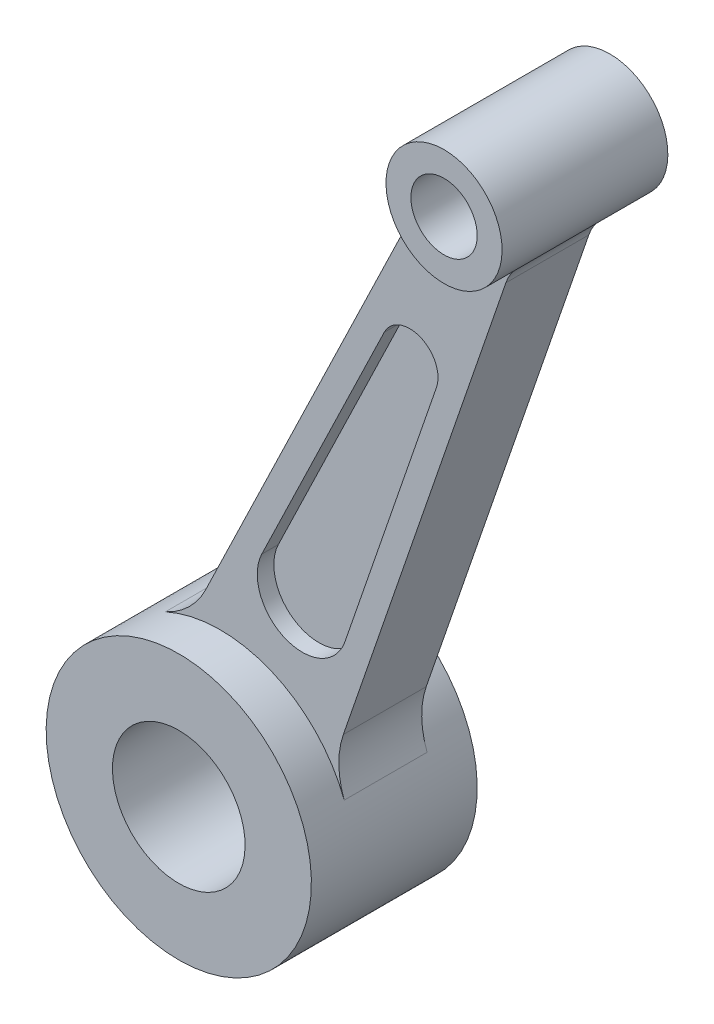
ISO-10303-21;
HEADER;
FILE_DESCRIPTION(('STEP AP214'),'2;1');
FILE_NAME('part.step','',(''),(''),'','','');
FILE_SCHEMA(('AUTOMOTIVE_DESIGN { 1 0 10303 214 1 1 1 1 }'));
ENDSEC;
DATA;
#1=APPLICATION_CONTEXT('core data for automotive mechanical design processes');
#2=APPLICATION_PROTOCOL_DEFINITION('international standard','automotive_design',2000,#1);
#3=PRODUCT_CONTEXT('',#1,'mechanical');
#4=PRODUCT('Part','Part','',(#3));
#5=PRODUCT_RELATED_PRODUCT_CATEGORY('part','',(#4));
#6=PRODUCT_DEFINITION_FORMATION('','',#4);
#7=PRODUCT_DEFINITION_CONTEXT('part definition',#1,'design');
#8=PRODUCT_DEFINITION('design','',#6,#7);
#9=PRODUCT_DEFINITION_SHAPE('','',#8);
#10=(LENGTH_UNIT() NAMED_UNIT(*) SI_UNIT(.MILLI.,.METRE.));
#11=(NAMED_UNIT(*) PLANE_ANGLE_UNIT() SI_UNIT($,.RADIAN.));
#12=(NAMED_UNIT(*) SI_UNIT($,.STERADIAN.) SOLID_ANGLE_UNIT());
#13=UNCERTAINTY_MEASURE_WITH_UNIT(LENGTH_MEASURE(1.E-05),#10,'distance_accuracy_value','');
#14=(GEOMETRIC_REPRESENTATION_CONTEXT(3) GLOBAL_UNCERTAINTY_ASSIGNED_CONTEXT((#13)) GLOBAL_UNIT_ASSIGNED_CONTEXT((#10,
#11,#12)) REPRESENTATION_CONTEXT('',''));
#15=CARTESIAN_POINT('',(0.,0.,0.));
#16=DIRECTION('',(0.,0.,1.));
#17=DIRECTION('',(1.,0.,0.));
#18=AXIS2_PLACEMENT_3D('',#15,#16,#17);
#19=CARTESIAN_POINT('',(-407.921191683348,-103.295185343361,326.402522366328));
#20=DIRECTION('',(0.,0.,1.));
#21=DIRECTION('',(0.924594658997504,-0.380952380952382,0.));
#22=AXIS2_PLACEMENT_3D('',#19,#20,#21);
#23=PLANE('',#22);
#24=CARTESIAN_POINT('',(-396.363758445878,-108.057090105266,326.402522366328));
#25=DIRECTION('',(0.,0.,1.));
#26=DIRECTION('',(0.924594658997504,-0.380952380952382,0.));
#27=AXIS2_PLACEMENT_3D('',#24,#25,#26);
#28=CIRCLE('',#27,17.5);
#29=CARTESIAN_POINT('',(-385.41330331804,-121.707640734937,326.402522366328));
#30=VERTEX_POINT('',#29);
#31=CARTESIAN_POINT('',(-413.75202252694,-110.031494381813,326.402522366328));
#32=VERTEX_POINT('',#31);
#33=EDGE_CURVE('E221',#30,#32,#28,.F.);
#34=ORIENTED_EDGE('',*,*,#33,.T.);
#35=CARTESIAN_POINT('',(-428.656248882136,-111.723840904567,326.402522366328));
#36=DIRECTION('',(0.,0.,1.));
#37=DIRECTION('',(0.924594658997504,-0.380952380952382,0.));
#38=AXIS2_PLACEMENT_3D('',#35,#36,#37);
#39=CIRCLE('',#38,15.);
#40=CARTESIAN_POINT('',(-415.151368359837,-118.252102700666,326.402522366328));
#41=VERTEX_POINT('',#40);
#42=EDGE_CURVE('E252',#32,#41,#39,.F.);
#43=ORIENTED_EDGE('',*,*,#42,.T.);
#44=DIRECTION('',(-0.43521745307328,-0.900325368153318,0.));
#45=VECTOR('',#44,1.);
#46=CARTESIAN_POINT('',(-407.921191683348,-103.295185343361,326.402522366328));
#47=LINE('',#46,#45);
#48=CARTESIAN_POINT('',(-480.733067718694,-253.91961144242,326.402522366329));
#49=VERTEX_POINT('',#48);
#50=EDGE_CURVE('E230',#41,#49,#47,.T.);
#51=ORIENTED_EDGE('',*,*,#50,.T.);
#52=CARTESIAN_POINT('',(-503.241201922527,-243.039175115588,326.402522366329));
#53=DIRECTION('',(0.,0.,1.));
#54=DIRECTION('',(0.924594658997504,-0.380952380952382,0.));
#55=AXIS2_PLACEMENT_3D('',#52,#53,#54);
#56=CIRCLE('',#55,25.);
#57=CARTESIAN_POINT('',(-492.903723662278,-265.801787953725,326.402522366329));
#58=VERTEX_POINT('',#57);
#59=EDGE_CURVE('E272',#49,#58,#56,.F.);
#60=ORIENTED_EDGE('',*,*,#59,.T.);
#61=CARTESIAN_POINT('',(-476.363758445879,-302.221968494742,326.402522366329));
#62=DIRECTION('',(0.,0.,1.));
#63=DIRECTION('',(0.924594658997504,-0.380952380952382,0.));
#64=AXIS2_PLACEMENT_3D('',#61,#62,#63);
#65=CIRCLE('',#64,40.);
#66=CARTESIAN_POINT('',(-438.968200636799,-288.024354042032,326.402522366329));
#67=VERTEX_POINT('',#66);
#68=EDGE_CURVE('E213',#58,#67,#65,.F.);
#69=ORIENTED_EDGE('',*,*,#68,.T.);
#70=CARTESIAN_POINT('',(-415.595977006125,-279.150845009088,326.402522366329));
#71=DIRECTION('',(0.,0.,1.));
#72=DIRECTION('',(0.924594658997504,-0.380952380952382,0.));
#73=AXIS2_PLACEMENT_3D('',#70,#71,#72);
#74=CIRCLE('',#73,25.);
#75=CARTESIAN_POINT('',(-439.235894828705,-271.017316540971,326.402522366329));
#76=VERTEX_POINT('',#75);
#77=EDGE_CURVE('E9',#67,#76,#74,.F.);
#78=ORIENTED_EDGE('',*,*,#77,.T.);
#79=DIRECTION('',(-0.325341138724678,-0.945596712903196,0.));
#80=VECTOR('',#79,1.);
#81=CARTESIAN_POINT('',(-384.80632520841,-112.818994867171,326.402522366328));
#82=LINE('',#81,#80);
#83=CARTESIAN_POINT('',(-390.211149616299,-128.527995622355,326.402522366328));
#84=VERTEX_POINT('',#83);
#85=EDGE_CURVE('E233',#84,#76,#82,.T.);
#86=ORIENTED_EDGE('',*,*,#85,.F.);
#87=CARTESIAN_POINT('',(-376.027198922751,-133.408112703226,326.402522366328));
#88=DIRECTION('',(0.,0.,1.));
#89=DIRECTION('',(0.924594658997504,-0.380952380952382,0.));
#90=AXIS2_PLACEMENT_3D('',#87,#88,#89);
#91=CIRCLE('',#90,15.);
#92=EDGE_CURVE('E256',#84,#30,#91,.F.);
#93=ORIENTED_EDGE('',*,*,#92,.T.);
#94=EDGE_LOOP('',(#34,#43,#51,#60,#69,#78,#86,#93));
#95=FACE_BOUND('',#94,.T.);
#96=DIRECTION('',(-0.43521745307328,-0.900325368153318,0.));
#97=VECTOR('',#96,1.);
#98=CARTESIAN_POINT('',(-426.91241044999,-159.814692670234,326.402522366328));
#99=LINE('',#98,#97);
#100=CARTESIAN_POINT('',(-426.91241044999,-159.814692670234,326.402522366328));
#101=VERTEX_POINT('',#100);
#102=CARTESIAN_POINT('',(-463.840532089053,-236.207136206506,326.402522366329));
#103=VERTEX_POINT('',#102);
#104=EDGE_CURVE('E183',#101,#103,#99,.T.);
#105=ORIENTED_EDGE('',*,*,#104,.F.);
#106=CARTESIAN_POINT('',(-419.220901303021,-163.532769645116,326.402522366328));
#107=DIRECTION('',(0.,0.,-1.));
#108=DIRECTION('',(-0.924594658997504,0.380952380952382,0.));
#109=AXIS2_PLACEMENT_3D('',#106,#107,#108);
#110=CIRCLE('',#109,8.54303279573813);
#111=CARTESIAN_POINT('',(-411.142637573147,-166.312169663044,326.402522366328));
#112=VERTEX_POINT('',#111);
#113=EDGE_CURVE('E136',#101,#112,#110,.T.);
#114=ORIENTED_EDGE('',*,*,#113,.T.);
#115=DIRECTION('',(0.325341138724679,0.945596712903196,0.));
#116=VECTOR('',#115,1.);
#117=CARTESIAN_POINT('',(-438.747773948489,-246.545878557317,326.402522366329));
#118=LINE('',#117,#116);
#119=CARTESIAN_POINT('',(-438.747773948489,-246.545878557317,326.402522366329));
#120=VERTEX_POINT('',#119);
#121=EDGE_CURVE('E177',#120,#112,#118,.T.);
#122=ORIENTED_EDGE('',*,*,#121,.F.);
#123=CARTESIAN_POINT('',(-451.601853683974,-242.123315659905,326.402522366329));
#124=DIRECTION('',(0.,0.,-1.));
#125=DIRECTION('',(-0.924594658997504,0.380952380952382,0.));
#126=AXIS2_PLACEMENT_3D('',#123,#124,#125);
#127=CIRCLE('',#126,13.5936171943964);
#128=EDGE_CURVE('E180',#120,#103,#127,.T.);
#129=ORIENTED_EDGE('',*,*,#128,.T.);
#130=EDGE_LOOP('',(#105,#114,#122,#129));
#131=FACE_BOUND('',#130,.T.);
#132=ADVANCED_FACE('F14',(#95,#131),#23,.T.);
#133=CARTESIAN_POINT('',(-407.921191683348,-103.295185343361,326.402522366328));
#134=DIRECTION('',(0.900325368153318,-0.43521745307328,0.));
#135=DIRECTION('',(0.43521745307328,0.900325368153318,0.));
#136=AXIS2_PLACEMENT_3D('',#133,#134,#135);
#137=PLANE('',#136);
#138=DIRECTION('',(-0.43521745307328,-0.900325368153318,0.));
#139=VECTOR('',#138,1.);
#140=CARTESIAN_POINT('',(-407.921191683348,-103.295185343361,301.402522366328));
#141=LINE('',#140,#139);
#142=CARTESIAN_POINT('',(-415.151368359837,-118.252102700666,301.402522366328));
#143=VERTEX_POINT('',#142);
#144=CARTESIAN_POINT('',(-480.733067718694,-253.91961144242,301.402522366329));
#145=VERTEX_POINT('',#144);
#146=EDGE_CURVE('E224',#143,#145,#141,.T.);
#147=ORIENTED_EDGE('',*,*,#146,.T.);
#148=DIRECTION('',(0.,0.,1.));
#149=VECTOR('',#148,1.);
#150=CARTESIAN_POINT('',(-480.733067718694,-253.91961144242,338.902522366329));
#151=LINE('',#150,#149);
#152=EDGE_CURVE('E266',#145,#49,#151,.T.);
#153=ORIENTED_EDGE('',*,*,#152,.T.);
#154=ORIENTED_EDGE('',*,*,#50,.F.);
#155=DIRECTION('',(0.,0.,1.));
#156=VECTOR('',#155,1.);
#157=CARTESIAN_POINT('',(-415.151368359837,-118.252102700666,338.902522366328));
#158=LINE('',#157,#156);
#159=EDGE_CURVE('E247',#41,#143,#158,.F.);
#160=ORIENTED_EDGE('',*,*,#159,.T.);
#161=EDGE_LOOP('',(#147,#153,#154,#160));
#162=FACE_BOUND('',#161,.T.);
#163=ADVANCED_FACE('F16',(#162),#137,.F.);
#164=CARTESIAN_POINT('',(-384.80632520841,-112.818994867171,326.402522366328));
#165=DIRECTION('',(0.945596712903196,-0.325341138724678,0.));
#166=DIRECTION('',(0.325341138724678,0.945596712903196,0.));
#167=AXIS2_PLACEMENT_3D('',#164,#165,#166);
#168=PLANE('',#167);
#169=ORIENTED_EDGE('',*,*,#85,.T.);
#170=DIRECTION('',(0.,0.,-1.));
#171=VECTOR('',#170,1.);
#172=CARTESIAN_POINT('',(-439.235894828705,-271.017316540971,326.402522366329));
#173=LINE('',#172,#171);
#174=CARTESIAN_POINT('',(-439.235894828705,-271.017316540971,301.402522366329));
#175=VERTEX_POINT('',#174);
#176=EDGE_CURVE('E268',#76,#175,#173,.T.);
#177=ORIENTED_EDGE('',*,*,#176,.T.);
#178=DIRECTION('',(-0.325341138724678,-0.945596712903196,0.));
#179=VECTOR('',#178,1.);
#180=CARTESIAN_POINT('',(-384.80632520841,-112.818994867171,301.402522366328));
#181=LINE('',#180,#179);
#182=CARTESIAN_POINT('',(-390.211149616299,-128.527995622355,301.402522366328));
#183=VERTEX_POINT('',#182);
#184=EDGE_CURVE('E227',#183,#175,#181,.T.);
#185=ORIENTED_EDGE('',*,*,#184,.F.);
#186=DIRECTION('',(0.,0.,-1.));
#187=VECTOR('',#186,1.);
#188=CARTESIAN_POINT('',(-390.211149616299,-128.527995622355,326.402522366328));
#189=LINE('',#188,#187);
#190=EDGE_CURVE('E249',#183,#84,#189,.F.);
#191=ORIENTED_EDGE('',*,*,#190,.T.);
#192=EDGE_LOOP('',(#169,#177,#185,#191));
#193=FACE_BOUND('',#192,.T.);
#194=ADVANCED_FACE('F282',(#193),#168,.T.);
#195=CARTESIAN_POINT('',(-407.921191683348,-103.295185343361,301.402522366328));
#196=DIRECTION('',(0.,0.,1.));
#197=DIRECTION('',(0.924594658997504,-0.380952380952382,0.));
#198=AXIS2_PLACEMENT_3D('',#195,#196,#197);
#199=PLANE('',#198);
#200=DIRECTION('',(0.325341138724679,0.945596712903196,0.));
#201=VECTOR('',#200,1.);
#202=CARTESIAN_POINT('',(-438.747773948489,-246.545878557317,301.402522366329));
#203=LINE('',#202,#201);
#204=CARTESIAN_POINT('',(-438.747773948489,-246.545878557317,301.402522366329));
#205=VERTEX_POINT('',#204);
#206=CARTESIAN_POINT('',(-411.142637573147,-166.312169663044,301.402522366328));
#207=VERTEX_POINT('',#206);
#208=EDGE_CURVE('E151',#205,#207,#203,.T.);
#209=ORIENTED_EDGE('',*,*,#208,.T.);
#210=CARTESIAN_POINT('',(-419.220901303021,-163.532769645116,301.402522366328));
#211=DIRECTION('',(0.,0.,-1.));
#212=DIRECTION('',(-0.924594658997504,0.380952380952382,0.));
#213=AXIS2_PLACEMENT_3D('',#210,#211,#212);
#214=CIRCLE('',#213,8.54303279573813);
#215=CARTESIAN_POINT('',(-426.91241044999,-159.814692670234,301.402522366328));
#216=VERTEX_POINT('',#215);
#217=EDGE_CURVE('E129',#216,#207,#214,.T.);
#218=ORIENTED_EDGE('',*,*,#217,.F.);
#219=DIRECTION('',(-0.43521745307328,-0.900325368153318,0.));
#220=VECTOR('',#219,1.);
#221=CARTESIAN_POINT('',(-426.91241044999,-159.814692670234,301.402522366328));
#222=LINE('',#221,#220);
#223=CARTESIAN_POINT('',(-463.840532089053,-236.207136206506,301.402522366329));
#224=VERTEX_POINT('',#223);
#225=EDGE_CURVE('E140',#216,#224,#222,.T.);
#226=ORIENTED_EDGE('',*,*,#225,.T.);
#227=CARTESIAN_POINT('',(-451.601853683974,-242.123315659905,301.402522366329));
#228=DIRECTION('',(0.,0.,-1.));
#229=DIRECTION('',(-0.924594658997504,0.380952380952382,0.));
#230=AXIS2_PLACEMENT_3D('',#227,#228,#229);
#231=CIRCLE('',#230,13.5936171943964);
#232=EDGE_CURVE('E145',#205,#224,#231,.T.);
#233=ORIENTED_EDGE('',*,*,#232,.F.);
#234=EDGE_LOOP('',(#209,#218,#226,#233));
#235=FACE_BOUND('',#234,.T.);
#236=CARTESIAN_POINT('',(-476.363758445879,-302.221968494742,301.402522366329));
#237=DIRECTION('',(0.,0.,1.));
#238=DIRECTION('',(0.924594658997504,-0.380952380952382,0.));
#239=AXIS2_PLACEMENT_3D('',#236,#237,#238);
#240=CIRCLE('',#239,40.);
#241=CARTESIAN_POINT('',(-492.903723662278,-265.801787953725,301.402522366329));
#242=VERTEX_POINT('',#241);
#243=CARTESIAN_POINT('',(-438.968200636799,-288.024354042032,301.402522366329));
#244=VERTEX_POINT('',#243);
#245=EDGE_CURVE('E238',#242,#244,#240,.F.);
#246=ORIENTED_EDGE('',*,*,#245,.F.);
#247=CARTESIAN_POINT('',(-503.241201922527,-243.039175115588,301.402522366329));
#248=DIRECTION('',(0.,0.,1.));
#249=DIRECTION('',(0.924594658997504,-0.380952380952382,0.));
#250=AXIS2_PLACEMENT_3D('',#247,#248,#249);
#251=CIRCLE('',#250,25.);
#252=EDGE_CURVE('E270',#242,#145,#251,.T.);
#253=ORIENTED_EDGE('',*,*,#252,.T.);
#254=ORIENTED_EDGE('',*,*,#146,.F.);
#255=CARTESIAN_POINT('',(-428.656248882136,-111.723840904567,301.402522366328));
#256=DIRECTION('',(0.,0.,1.));
#257=DIRECTION('',(0.924594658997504,-0.380952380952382,0.));
#258=AXIS2_PLACEMENT_3D('',#255,#256,#257);
#259=CIRCLE('',#258,15.);
#260=CARTESIAN_POINT('',(-413.75202252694,-110.031494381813,301.402522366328));
#261=VERTEX_POINT('',#260);
#262=EDGE_CURVE('E254',#143,#261,#259,.T.);
#263=ORIENTED_EDGE('',*,*,#262,.T.);
#264=CARTESIAN_POINT('',(-396.363758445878,-108.057090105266,301.402522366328));
#265=DIRECTION('',(0.,0.,1.));
#266=DIRECTION('',(0.924594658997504,-0.380952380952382,0.));
#267=AXIS2_PLACEMENT_3D('',#264,#265,#266);
#268=CIRCLE('',#267,17.5);
#269=CARTESIAN_POINT('',(-385.41330331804,-121.707640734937,301.402522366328));
#270=VERTEX_POINT('',#269);
#271=EDGE_CURVE('E235',#270,#261,#268,.F.);
#272=ORIENTED_EDGE('',*,*,#271,.F.);
#273=CARTESIAN_POINT('',(-376.027198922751,-133.408112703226,301.402522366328));
#274=DIRECTION('',(0.,0.,1.));
#275=DIRECTION('',(0.924594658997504,-0.380952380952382,0.));
#276=AXIS2_PLACEMENT_3D('',#273,#274,#275);
#277=CIRCLE('',#276,15.);
#278=EDGE_CURVE('E258',#270,#183,#277,.T.);
#279=ORIENTED_EDGE('',*,*,#278,.T.);
#280=ORIENTED_EDGE('',*,*,#184,.T.);
#281=CARTESIAN_POINT('',(-415.595977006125,-279.150845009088,301.402522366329));
#282=DIRECTION('',(0.,0.,1.));
#283=DIRECTION('',(0.924594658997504,-0.380952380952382,0.));
#284=AXIS2_PLACEMENT_3D('',#281,#282,#283);
#285=CIRCLE('',#284,25.);
#286=EDGE_CURVE('E22',#175,#244,#285,.T.);
#287=ORIENTED_EDGE('',*,*,#286,.T.);
#288=EDGE_LOOP('',(#246,#253,#254,#263,#272,#279,#280,#287));
#289=FACE_BOUND('',#288,.T.);
#290=ADVANCED_FACE('F148',(#235,#289),#199,.F.);
#291=CARTESIAN_POINT('',(-396.363758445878,-108.057090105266,338.902522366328));
#292=DIRECTION('',(0.,0.,-1.));
#293=DIRECTION('',(-0.924594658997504,0.380952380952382,0.));
#294=AXIS2_PLACEMENT_3D('',#291,#292,#293);
#295=CYLINDRICAL_SURFACE('',#294,17.5);
#296=DIRECTION('',(0.,0.,-1.));
#297=VECTOR('',#296,1.);
#298=CARTESIAN_POINT('',(-413.75202252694,-110.031494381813,338.902522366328));
#299=LINE('',#298,#297);
#300=EDGE_CURVE('E244',#261,#32,#299,.F.);
#301=ORIENTED_EDGE('',*,*,#300,.T.);
#302=ORIENTED_EDGE('',*,*,#33,.F.);
#303=DIRECTION('',(0.,0.,-1.));
#304=VECTOR('',#303,1.);
#305=CARTESIAN_POINT('',(-385.41330331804,-121.707640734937,338.902522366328));
#306=LINE('',#305,#304);
#307=EDGE_CURVE('E241',#30,#270,#306,.T.);
#308=ORIENTED_EDGE('',*,*,#307,.T.);
#309=ORIENTED_EDGE('',*,*,#271,.T.);
#310=EDGE_LOOP('',(#301,#302,#308,#309));
#311=FACE_BOUND('',#310,.T.);
#312=CARTESIAN_POINT('',(-396.363758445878,-108.057090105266,338.902522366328));
#313=DIRECTION('',(0.,0.,1.));
#314=DIRECTION('',(0.924594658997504,-0.380952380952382,0.));
#315=AXIS2_PLACEMENT_3D('',#312,#313,#314);
#316=CIRCLE('',#315,17.5);
#317=CARTESIAN_POINT('',(-380.183351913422,-114.723756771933,338.902522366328));
#318=VERTEX_POINT('',#317);
#319=EDGE_CURVE('E218',#318,#318,#316,.T.);
#320=ORIENTED_EDGE('',*,*,#319,.F.);
#321=EDGE_LOOP('',(#320));
#322=FACE_BOUND('',#321,.T.);
#323=CARTESIAN_POINT('',(-396.363758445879,-108.057090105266,288.902522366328));
#324=DIRECTION('',(0.,0.,1.));
#325=DIRECTION('',(0.924594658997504,-0.380952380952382,0.));
#326=AXIS2_PLACEMENT_3D('',#323,#324,#325);
#327=CIRCLE('',#326,17.5);
#328=CARTESIAN_POINT('',(-380.183351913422,-114.723756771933,288.902522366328));
#329=VERTEX_POINT('',#328);
#330=EDGE_CURVE('E215',#329,#329,#327,.T.);
#331=ORIENTED_EDGE('',*,*,#330,.T.);
#332=EDGE_LOOP('',(#331));
#333=FACE_BOUND('',#332,.T.);
#334=ADVANCED_FACE('F289',(#311,#322,#333),#295,.T.);
#335=CARTESIAN_POINT('',(-396.363758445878,-108.057090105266,338.902522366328));
#336=DIRECTION('',(0.,0.,1.));
#337=DIRECTION('',(0.924594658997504,-0.380952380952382,0.));
#338=AXIS2_PLACEMENT_3D('',#335,#336,#337);
#339=PLANE('',#338);
#340=CARTESIAN_POINT('',(-396.363758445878,-108.057090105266,338.902522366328));
#341=DIRECTION('',(0.,0.,1.));
#342=DIRECTION('',(0.924594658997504,-0.380952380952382,0.));
#343=AXIS2_PLACEMENT_3D('',#340,#341,#342);
#344=CIRCLE('',#343,10.);
#345=CARTESIAN_POINT('',(-387.117811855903,-111.86661391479,338.902522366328));
#346=VERTEX_POINT('',#345);
#347=EDGE_CURVE('E155',#346,#346,#344,.T.);
#348=ORIENTED_EDGE('',*,*,#347,.F.);
#349=EDGE_LOOP('',(#348));
#350=FACE_BOUND('',#349,.T.);
#351=ORIENTED_EDGE('',*,*,#319,.T.);
#352=EDGE_LOOP('',(#351));
#353=FACE_BOUND('',#352,.T.);
#354=ADVANCED_FACE('F326',(#350,#353),#339,.T.);
#355=CARTESIAN_POINT('',(-396.363758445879,-108.057090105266,288.902522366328));
#356=DIRECTION('',(0.,0.,1.));
#357=DIRECTION('',(0.924594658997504,-0.380952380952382,0.));
#358=AXIS2_PLACEMENT_3D('',#355,#356,#357);
#359=PLANE('',#358);
#360=CARTESIAN_POINT('',(-396.363758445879,-108.057090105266,288.902522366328));
#361=DIRECTION('',(0.,0.,1.));
#362=DIRECTION('',(0.924594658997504,-0.380952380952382,0.));
#363=AXIS2_PLACEMENT_3D('',#360,#361,#362);
#364=CIRCLE('',#363,10.);
#365=CARTESIAN_POINT('',(-387.117811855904,-111.86661391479,288.902522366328));
#366=VERTEX_POINT('',#365);
#367=EDGE_CURVE('E152',#366,#366,#364,.T.);
#368=ORIENTED_EDGE('',*,*,#367,.T.);
#369=EDGE_LOOP('',(#368));
#370=FACE_BOUND('',#369,.T.);
#371=ORIENTED_EDGE('',*,*,#330,.F.);
#372=EDGE_LOOP('',(#371));
#373=FACE_BOUND('',#372,.T.);
#374=ADVANCED_FACE('F330',(#370,#373),#359,.F.);
#375=CARTESIAN_POINT('',(-476.363758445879,-302.221968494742,338.902522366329));
#376=DIRECTION('',(0.,0.,-1.));
#377=DIRECTION('',(-0.924594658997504,0.380952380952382,0.));
#378=AXIS2_PLACEMENT_3D('',#375,#376,#377);
#379=CYLINDRICAL_SURFACE('',#378,40.);
#380=DIRECTION('',(0.,0.,-1.));
#381=VECTOR('',#380,1.);
#382=CARTESIAN_POINT('',(-492.903723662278,-265.801787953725,338.902522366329));
#383=LINE('',#382,#381);
#384=EDGE_CURVE('E263',#58,#242,#383,.T.);
#385=ORIENTED_EDGE('',*,*,#384,.T.);
#386=ORIENTED_EDGE('',*,*,#245,.T.);
#387=DIRECTION('',(0.,0.,-1.));
#388=VECTOR('',#387,1.);
#389=CARTESIAN_POINT('',(-438.968200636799,-288.024354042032,338.902522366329));
#390=LINE('',#389,#388);
#391=EDGE_CURVE('E260',#244,#67,#390,.F.);
#392=ORIENTED_EDGE('',*,*,#391,.T.);
#393=ORIENTED_EDGE('',*,*,#68,.F.);
#394=EDGE_LOOP('',(#385,#386,#392,#393));
#395=FACE_BOUND('',#394,.T.);
#396=CARTESIAN_POINT('',(-476.363758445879,-302.221968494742,338.902522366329));
#397=DIRECTION('',(0.,0.,1.));
#398=DIRECTION('',(0.924594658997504,-0.380952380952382,0.));
#399=AXIS2_PLACEMENT_3D('',#396,#397,#398);
#400=CIRCLE('',#399,40.);
#401=CARTESIAN_POINT('',(-439.379972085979,-317.460063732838,338.902522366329));
#402=VERTEX_POINT('',#401);
#403=EDGE_CURVE('E210',#402,#402,#400,.T.);
#404=ORIENTED_EDGE('',*,*,#403,.F.);
#405=EDGE_LOOP('',(#404));
#406=FACE_BOUND('',#405,.T.);
#407=CARTESIAN_POINT('',(-476.363758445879,-302.221968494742,288.902522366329));
#408=DIRECTION('',(0.,0.,1.));
#409=DIRECTION('',(0.924594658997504,-0.380952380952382,0.));
#410=AXIS2_PLACEMENT_3D('',#407,#408,#409);
#411=CIRCLE('',#410,40.);
#412=CARTESIAN_POINT('',(-439.379972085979,-317.460063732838,288.902522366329));
#413=VERTEX_POINT('',#412);
#414=EDGE_CURVE('E207',#413,#413,#411,.T.);
#415=ORIENTED_EDGE('',*,*,#414,.T.);
#416=EDGE_LOOP('',(#415));
#417=FACE_BOUND('',#416,.T.);
#418=ADVANCED_FACE('F276',(#395,#406,#417),#379,.T.);
#419=CARTESIAN_POINT('',(-476.363758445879,-302.221968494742,338.902522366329));
#420=DIRECTION('',(0.,0.,1.));
#421=DIRECTION('',(0.924594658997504,-0.380952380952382,0.));
#422=AXIS2_PLACEMENT_3D('',#419,#420,#421);
#423=PLANE('',#422);
#424=CARTESIAN_POINT('',(-476.363758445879,-302.221968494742,338.902522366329));
#425=DIRECTION('',(0.,0.,1.));
#426=DIRECTION('',(0.924594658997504,-0.380952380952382,0.));
#427=AXIS2_PLACEMENT_3D('',#424,#425,#426);
#428=CIRCLE('',#427,20.);
#429=CARTESIAN_POINT('',(-457.871865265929,-309.84101611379,338.902522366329));
#430=VERTEX_POINT('',#429);
#431=EDGE_CURVE('E690',#430,#430,#428,.T.);
#432=ORIENTED_EDGE('',*,*,#431,.F.);
#433=EDGE_LOOP('',(#432));
#434=FACE_BOUND('',#433,.T.);
#435=ORIENTED_EDGE('',*,*,#403,.T.);
#436=EDGE_LOOP('',(#435));
#437=FACE_BOUND('',#436,.T.);
#438=ADVANCED_FACE('F339',(#434,#437),#423,.T.);
#439=CARTESIAN_POINT('',(-476.363758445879,-302.221968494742,288.902522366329));
#440=DIRECTION('',(0.,0.,1.));
#441=DIRECTION('',(0.924594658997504,-0.380952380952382,0.));
#442=AXIS2_PLACEMENT_3D('',#439,#440,#441);
#443=PLANE('',#442);
#444=CARTESIAN_POINT('',(-476.363758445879,-302.221968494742,288.902522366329));
#445=DIRECTION('',(0.,0.,1.));
#446=DIRECTION('',(0.924594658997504,-0.380952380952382,0.));
#447=AXIS2_PLACEMENT_3D('',#444,#445,#446);
#448=CIRCLE('',#447,20.);
#449=CARTESIAN_POINT('',(-457.871865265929,-309.84101611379,288.902522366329));
#450=VERTEX_POINT('',#449);
#451=EDGE_CURVE('E687',#450,#450,#448,.T.);
#452=ORIENTED_EDGE('',*,*,#451,.T.);
#453=EDGE_LOOP('',(#452));
#454=FACE_BOUND('',#453,.T.);
#455=ORIENTED_EDGE('',*,*,#414,.F.);
#456=EDGE_LOOP('',(#455));
#457=FACE_BOUND('',#456,.T.);
#458=ADVANCED_FACE('F345',(#454,#457),#443,.F.);
#459=CARTESIAN_POINT('',(-419.220901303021,-163.532769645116,321.402522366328));
#460=DIRECTION('',(0.,0.,1.));
#461=DIRECTION('',(0.924594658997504,-0.380952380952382,0.));
#462=AXIS2_PLACEMENT_3D('',#459,#460,#461);
#463=CYLINDRICAL_SURFACE('',#462,8.54303279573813);
#464=DIRECTION('',(0.,0.,1.));
#465=VECTOR('',#464,1.);
#466=CARTESIAN_POINT('',(-411.142637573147,-166.312169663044,321.402522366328));
#467=LINE('',#466,#465);
#468=CARTESIAN_POINT('',(-411.142637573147,-166.312169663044,321.402522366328));
#469=VERTEX_POINT('',#468);
#470=EDGE_CURVE('E205',#469,#112,#467,.T.);
#471=ORIENTED_EDGE('',*,*,#470,.T.);
#472=ORIENTED_EDGE('',*,*,#113,.F.);
#473=DIRECTION('',(0.,0.,1.));
#474=VECTOR('',#473,1.);
#475=CARTESIAN_POINT('',(-426.91241044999,-159.814692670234,321.402522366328));
#476=LINE('',#475,#474);
#477=CARTESIAN_POINT('',(-426.91241044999,-159.814692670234,321.402522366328));
#478=VERTEX_POINT('',#477);
#479=EDGE_CURVE('E198',#478,#101,#476,.T.);
#480=ORIENTED_EDGE('',*,*,#479,.F.);
#481=CARTESIAN_POINT('',(-419.220901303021,-163.532769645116,321.402522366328));
#482=DIRECTION('',(0.,0.,-1.));
#483=DIRECTION('',(-0.924594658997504,0.380952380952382,0.));
#484=AXIS2_PLACEMENT_3D('',#481,#482,#483);
#485=CIRCLE('',#484,8.54303279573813);
#486=EDGE_CURVE('E186',#478,#469,#485,.T.);
#487=ORIENTED_EDGE('',*,*,#486,.T.);
#488=EDGE_LOOP('',(#471,#472,#480,#487));
#489=FACE_BOUND('',#488,.T.);
#490=ADVANCED_FACE('F351',(#489),#463,.F.);
#491=CARTESIAN_POINT('',(-438.747773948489,-246.545878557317,321.402522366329));
#492=DIRECTION('',(0.945596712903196,-0.325341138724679,0.));
#493=DIRECTION('',(0.325341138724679,0.945596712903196,0.));
#494=AXIS2_PLACEMENT_3D('',#491,#492,#493);
#495=PLANE('',#494);
#496=DIRECTION('',(0.,0.,1.));
#497=VECTOR('',#496,1.);
#498=CARTESIAN_POINT('',(-438.747773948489,-246.545878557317,321.402522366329));
#499=LINE('',#498,#497);
#500=CARTESIAN_POINT('',(-438.747773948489,-246.545878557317,321.402522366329));
#501=VERTEX_POINT('',#500);
#502=EDGE_CURVE('E203',#501,#120,#499,.T.);
#503=ORIENTED_EDGE('',*,*,#502,.T.);
#504=ORIENTED_EDGE('',*,*,#121,.T.);
#505=ORIENTED_EDGE('',*,*,#470,.F.);
#506=DIRECTION('',(0.325341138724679,0.945596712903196,0.));
#507=VECTOR('',#506,1.);
#508=CARTESIAN_POINT('',(-438.747773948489,-246.545878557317,321.402522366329));
#509=LINE('',#508,#507);
#510=EDGE_CURVE('E189',#501,#469,#509,.T.);
#511=ORIENTED_EDGE('',*,*,#510,.F.);
#512=EDGE_LOOP('',(#503,#504,#505,#511));
#513=FACE_BOUND('',#512,.T.);
#514=ADVANCED_FACE('F353',(#513),#495,.F.);
#515=CARTESIAN_POINT('',(-451.601853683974,-242.123315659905,321.402522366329));
#516=DIRECTION('',(0.,0.,1.));
#517=DIRECTION('',(0.924594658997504,-0.380952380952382,0.));
#518=AXIS2_PLACEMENT_3D('',#515,#516,#517);
#519=CYLINDRICAL_SURFACE('',#518,13.5936171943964);
#520=DIRECTION('',(0.,0.,1.));
#521=VECTOR('',#520,1.);
#522=CARTESIAN_POINT('',(-463.840532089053,-236.207136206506,321.402522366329));
#523=LINE('',#522,#521);
#524=CARTESIAN_POINT('',(-463.840532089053,-236.207136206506,321.402522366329));
#525=VERTEX_POINT('',#524);
#526=EDGE_CURVE('E201',#525,#103,#523,.T.);
#527=ORIENTED_EDGE('',*,*,#526,.T.);
#528=ORIENTED_EDGE('',*,*,#128,.F.);
#529=ORIENTED_EDGE('',*,*,#502,.F.);
#530=CARTESIAN_POINT('',(-451.601853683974,-242.123315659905,321.402522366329));
#531=DIRECTION('',(0.,0.,-1.));
#532=DIRECTION('',(-0.924594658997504,0.380952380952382,0.));
#533=AXIS2_PLACEMENT_3D('',#530,#531,#532);
#534=CIRCLE('',#533,13.5936171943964);
#535=EDGE_CURVE('E192',#501,#525,#534,.T.);
#536=ORIENTED_EDGE('',*,*,#535,.T.);
#537=EDGE_LOOP('',(#527,#528,#529,#536));
#538=FACE_BOUND('',#537,.T.);
#539=ADVANCED_FACE('F356',(#538),#519,.F.);
#540=CARTESIAN_POINT('',(-426.91241044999,-159.814692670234,321.402522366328));
#541=DIRECTION('',(-0.900325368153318,0.43521745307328,0.));
#542=DIRECTION('',(-0.43521745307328,-0.900325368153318,0.));
#543=AXIS2_PLACEMENT_3D('',#540,#541,#542);
#544=PLANE('',#543);
#545=DIRECTION('',(-0.43521745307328,-0.900325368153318,0.));
#546=VECTOR('',#545,1.);
#547=CARTESIAN_POINT('',(-426.91241044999,-159.814692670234,321.402522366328));
#548=LINE('',#547,#546);
#549=EDGE_CURVE('E195',#478,#525,#548,.T.);
#550=ORIENTED_EDGE('',*,*,#549,.F.);
#551=ORIENTED_EDGE('',*,*,#479,.T.);
#552=ORIENTED_EDGE('',*,*,#104,.T.);
#553=ORIENTED_EDGE('',*,*,#526,.F.);
#554=EDGE_LOOP('',(#550,#551,#552,#553));
#555=FACE_BOUND('',#554,.T.);
#556=ADVANCED_FACE('F360',(#555),#544,.F.);
#557=CARTESIAN_POINT('',(-419.220901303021,-163.532769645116,321.402522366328));
#558=DIRECTION('',(0.,0.,-1.));
#559=DIRECTION('',(-0.924594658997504,0.380952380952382,0.));
#560=AXIS2_PLACEMENT_3D('',#557,#558,#559);
#561=PLANE('',#560);
#562=ORIENTED_EDGE('',*,*,#486,.F.);
#563=ORIENTED_EDGE('',*,*,#549,.T.);
#564=ORIENTED_EDGE('',*,*,#535,.F.);
#565=ORIENTED_EDGE('',*,*,#510,.T.);
#566=EDGE_LOOP('',(#562,#563,#564,#565));
#567=FACE_BOUND('',#566,.T.);
#568=ADVANCED_FACE('F362',(#567),#561,.F.);
#569=CARTESIAN_POINT('',(-419.220901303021,-163.532769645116,306.402522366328));
#570=DIRECTION('',(0.,0.,-1.));
#571=DIRECTION('',(-0.924594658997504,0.380952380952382,0.));
#572=AXIS2_PLACEMENT_3D('',#569,#570,#571);
#573=CYLINDRICAL_SURFACE('',#572,8.54303279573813);
#574=DIRECTION('',(0.,0.,-1.));
#575=VECTOR('',#574,1.);
#576=CARTESIAN_POINT('',(-426.91241044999,-159.814692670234,306.402522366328));
#577=LINE('',#576,#575);
#578=CARTESIAN_POINT('',(-426.91241044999,-159.814692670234,306.402522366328));
#579=VERTEX_POINT('',#578);
#580=EDGE_CURVE('E125',#579,#216,#577,.T.);
#581=ORIENTED_EDGE('',*,*,#580,.T.);
#582=ORIENTED_EDGE('',*,*,#217,.T.);
#583=DIRECTION('',(0.,0.,-1.));
#584=VECTOR('',#583,1.);
#585=CARTESIAN_POINT('',(-411.142637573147,-166.312169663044,306.402522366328));
#586=LINE('',#585,#584);
#587=CARTESIAN_POINT('',(-411.142637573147,-166.312169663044,306.402522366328));
#588=VERTEX_POINT('',#587);
#589=EDGE_CURVE('E170',#588,#207,#586,.T.);
#590=ORIENTED_EDGE('',*,*,#589,.F.);
#591=CARTESIAN_POINT('',(-419.220901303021,-163.532769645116,306.402522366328));
#592=DIRECTION('',(0.,0.,-1.));
#593=DIRECTION('',(-0.924594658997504,0.380952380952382,0.));
#594=AXIS2_PLACEMENT_3D('',#591,#592,#593);
#595=CIRCLE('',#594,8.54303279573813);
#596=EDGE_CURVE('E132',#579,#588,#595,.T.);
#597=ORIENTED_EDGE('',*,*,#596,.F.);
#598=EDGE_LOOP('',(#581,#582,#590,#597));
#599=FACE_BOUND('',#598,.T.);
#600=ADVANCED_FACE('F127',(#599),#573,.F.);
#601=CARTESIAN_POINT('',(-426.91241044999,-159.814692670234,306.402522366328));
#602=DIRECTION('',(0.900325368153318,-0.43521745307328,0.));
#603=DIRECTION('',(0.43521745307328,0.900325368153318,0.));
#604=AXIS2_PLACEMENT_3D('',#601,#602,#603);
#605=PLANE('',#604);
#606=DIRECTION('',(0.,0.,-1.));
#607=VECTOR('',#606,1.);
#608=CARTESIAN_POINT('',(-463.840532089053,-236.207136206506,306.402522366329));
#609=LINE('',#608,#607);
#610=CARTESIAN_POINT('',(-463.840532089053,-236.207136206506,306.402522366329));
#611=VERTEX_POINT('',#610);
#612=EDGE_CURVE('E137',#611,#224,#609,.T.);
#613=ORIENTED_EDGE('',*,*,#612,.T.);
#614=ORIENTED_EDGE('',*,*,#225,.F.);
#615=ORIENTED_EDGE('',*,*,#580,.F.);
#616=DIRECTION('',(-0.43521745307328,-0.900325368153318,0.));
#617=VECTOR('',#616,1.);
#618=CARTESIAN_POINT('',(-426.91241044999,-159.814692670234,306.402522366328));
#619=LINE('',#618,#617);
#620=EDGE_CURVE('E162',#579,#611,#619,.T.);
#621=ORIENTED_EDGE('',*,*,#620,.T.);
#622=EDGE_LOOP('',(#613,#614,#615,#621));
#623=FACE_BOUND('',#622,.T.);
#624=ADVANCED_FACE('F141',(#623),#605,.T.);
#625=CARTESIAN_POINT('',(-451.601853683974,-242.123315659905,306.402522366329));
#626=DIRECTION('',(0.,0.,-1.));
#627=DIRECTION('',(-0.924594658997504,0.380952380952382,0.));
#628=AXIS2_PLACEMENT_3D('',#625,#626,#627);
#629=CYLINDRICAL_SURFACE('',#628,13.5936171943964);
#630=DIRECTION('',(0.,0.,-1.));
#631=VECTOR('',#630,1.);
#632=CARTESIAN_POINT('',(-438.747773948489,-246.545878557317,306.402522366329));
#633=LINE('',#632,#631);
#634=CARTESIAN_POINT('',(-438.747773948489,-246.545878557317,306.402522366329));
#635=VERTEX_POINT('',#634);
#636=EDGE_CURVE('E172',#635,#205,#633,.T.);
#637=ORIENTED_EDGE('',*,*,#636,.T.);
#638=ORIENTED_EDGE('',*,*,#232,.T.);
#639=ORIENTED_EDGE('',*,*,#612,.F.);
#640=CARTESIAN_POINT('',(-451.601853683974,-242.123315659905,306.402522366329));
#641=DIRECTION('',(0.,0.,-1.));
#642=DIRECTION('',(-0.924594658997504,0.380952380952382,0.));
#643=AXIS2_PLACEMENT_3D('',#640,#641,#642);
#644=CIRCLE('',#643,13.5936171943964);
#645=EDGE_CURVE('E164',#635,#611,#644,.T.);
#646=ORIENTED_EDGE('',*,*,#645,.F.);
#647=EDGE_LOOP('',(#637,#638,#639,#646));
#648=FACE_BOUND('',#647,.T.);
#649=ADVANCED_FACE('F374',(#648),#629,.F.);
#650=CARTESIAN_POINT('',(-438.747773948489,-246.545878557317,306.402522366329));
#651=DIRECTION('',(-0.945596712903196,0.325341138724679,0.));
#652=DIRECTION('',(-0.325341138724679,-0.945596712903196,0.));
#653=AXIS2_PLACEMENT_3D('',#650,#651,#652);
#654=PLANE('',#653);
#655=DIRECTION('',(0.325341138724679,0.945596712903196,0.));
#656=VECTOR('',#655,1.);
#657=CARTESIAN_POINT('',(-438.747773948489,-246.545878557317,306.402522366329));
#658=LINE('',#657,#656);
#659=EDGE_CURVE('E167',#635,#588,#658,.T.);
#660=ORIENTED_EDGE('',*,*,#659,.T.);
#661=ORIENTED_EDGE('',*,*,#589,.T.);
#662=ORIENTED_EDGE('',*,*,#208,.F.);
#663=ORIENTED_EDGE('',*,*,#636,.F.);
#664=EDGE_LOOP('',(#660,#661,#662,#663));
#665=FACE_BOUND('',#664,.T.);
#666=ADVANCED_FACE('F377',(#665),#654,.T.);
#667=CARTESIAN_POINT('',(-419.220901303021,-163.532769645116,306.402522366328));
#668=DIRECTION('',(0.,0.,1.));
#669=DIRECTION('',(-0.924594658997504,0.380952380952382,0.));
#670=AXIS2_PLACEMENT_3D('',#667,#668,#669);
#671=PLANE('',#670);
#672=ORIENTED_EDGE('',*,*,#596,.T.);
#673=ORIENTED_EDGE('',*,*,#659,.F.);
#674=ORIENTED_EDGE('',*,*,#645,.T.);
#675=ORIENTED_EDGE('',*,*,#620,.F.);
#676=EDGE_LOOP('',(#672,#673,#674,#675));
#677=FACE_BOUND('',#676,.T.);
#678=ADVANCED_FACE('F379',(#677),#671,.F.);
#679=CARTESIAN_POINT('',(-428.656248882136,-111.723840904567,338.902522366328));
#680=DIRECTION('',(0.,0.,-1.));
#681=DIRECTION('',(-0.924594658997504,0.380952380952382,0.));
#682=AXIS2_PLACEMENT_3D('',#679,#680,#681);
#683=CYLINDRICAL_SURFACE('',#682,15.);
#684=ORIENTED_EDGE('',*,*,#262,.F.);
#685=ORIENTED_EDGE('',*,*,#159,.F.);
#686=ORIENTED_EDGE('',*,*,#42,.F.);
#687=ORIENTED_EDGE('',*,*,#300,.F.);
#688=EDGE_LOOP('',(#684,#685,#686,#687));
#689=FACE_BOUND('',#688,.T.);
#690=ADVANCED_FACE('F297',(#689),#683,.F.);
#691=CARTESIAN_POINT('',(-376.027198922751,-133.408112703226,338.902522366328));
#692=DIRECTION('',(0.,0.,-1.));
#693=DIRECTION('',(-0.924594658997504,0.380952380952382,0.));
#694=AXIS2_PLACEMENT_3D('',#691,#692,#693);
#695=CYLINDRICAL_SURFACE('',#694,15.);
#696=ORIENTED_EDGE('',*,*,#278,.F.);
#697=ORIENTED_EDGE('',*,*,#307,.F.);
#698=ORIENTED_EDGE('',*,*,#92,.F.);
#699=ORIENTED_EDGE('',*,*,#190,.F.);
#700=EDGE_LOOP('',(#696,#697,#698,#699));
#701=FACE_BOUND('',#700,.T.);
#702=ADVANCED_FACE('F293',(#701),#695,.F.);
#703=CARTESIAN_POINT('',(-503.241201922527,-243.039175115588,338.902522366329));
#704=DIRECTION('',(0.,0.,-1.));
#705=DIRECTION('',(-0.924594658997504,0.380952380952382,0.));
#706=AXIS2_PLACEMENT_3D('',#703,#704,#705);
#707=CYLINDRICAL_SURFACE('',#706,25.);
#708=ORIENTED_EDGE('',*,*,#59,.F.);
#709=ORIENTED_EDGE('',*,*,#152,.F.);
#710=ORIENTED_EDGE('',*,*,#252,.F.);
#711=ORIENTED_EDGE('',*,*,#384,.F.);
#712=EDGE_LOOP('',(#708,#709,#710,#711));
#713=FACE_BOUND('',#712,.T.);
#714=ADVANCED_FACE('F304',(#713),#707,.F.);
#715=CARTESIAN_POINT('',(-415.595977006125,-279.150845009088,338.902522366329));
#716=DIRECTION('',(0.,0.,-1.));
#717=DIRECTION('',(-0.924594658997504,0.380952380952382,0.));
#718=AXIS2_PLACEMENT_3D('',#715,#716,#717);
#719=CYLINDRICAL_SURFACE('',#718,25.);
#720=ORIENTED_EDGE('',*,*,#77,.F.);
#721=ORIENTED_EDGE('',*,*,#391,.F.);
#722=ORIENTED_EDGE('',*,*,#286,.F.);
#723=ORIENTED_EDGE('',*,*,#176,.F.);
#724=EDGE_LOOP('',(#720,#721,#722,#723));
#725=FACE_BOUND('',#724,.T.);
#726=ADVANCED_FACE('F280',(#725),#719,.F.);
#727=CARTESIAN_POINT('',(-396.363758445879,-108.057090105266,288.902522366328));
#728=DIRECTION('',(0.,0.,1.));
#729=DIRECTION('',(0.924594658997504,-0.380952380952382,0.));
#730=AXIS2_PLACEMENT_3D('',#727,#728,#729);
#731=CYLINDRICAL_SURFACE('',#730,10.);
#732=ORIENTED_EDGE('',*,*,#367,.F.);
#733=EDGE_LOOP('',(#732));
#734=FACE_BOUND('',#733,.T.);
#735=ORIENTED_EDGE('',*,*,#347,.T.);
#736=EDGE_LOOP('',(#735));
#737=FACE_BOUND('',#736,.T.);
#738=ADVANCED_FACE('F312',(#734,#737),#731,.F.);
#739=CARTESIAN_POINT('',(-476.363758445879,-302.221968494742,288.902522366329));
#740=DIRECTION('',(0.,0.,1.));
#741=DIRECTION('',(0.924594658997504,-0.380952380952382,0.));
#742=AXIS2_PLACEMENT_3D('',#739,#740,#741);
#743=CYLINDRICAL_SURFACE('',#742,20.);
#744=ORIENTED_EDGE('',*,*,#451,.F.);
#745=EDGE_LOOP('',(#744));
#746=FACE_BOUND('',#745,.T.);
#747=ORIENTED_EDGE('',*,*,#431,.T.);
#748=EDGE_LOOP('',(#747));
#749=FACE_BOUND('',#748,.T.);
#750=ADVANCED_FACE('F425',(#746,#749),#743,.F.);
#751=CLOSED_SHELL('',(#132,#163,#194,#290,#334,#354,#374,#418,#438,#458,#490,#514,#539,#556,
#568,#600,#624,#649,#666,#678,#690,#702,#714,#726,#738,#750));
#752=MANIFOLD_SOLID_BREP('B1',#751);
#753=ADVANCED_BREP_SHAPE_REPRESENTATION('',(#18,#752),#14);
#754=SHAPE_DEFINITION_REPRESENTATION(#9,#753);
ENDSEC;
END-ISO-10303-21;
